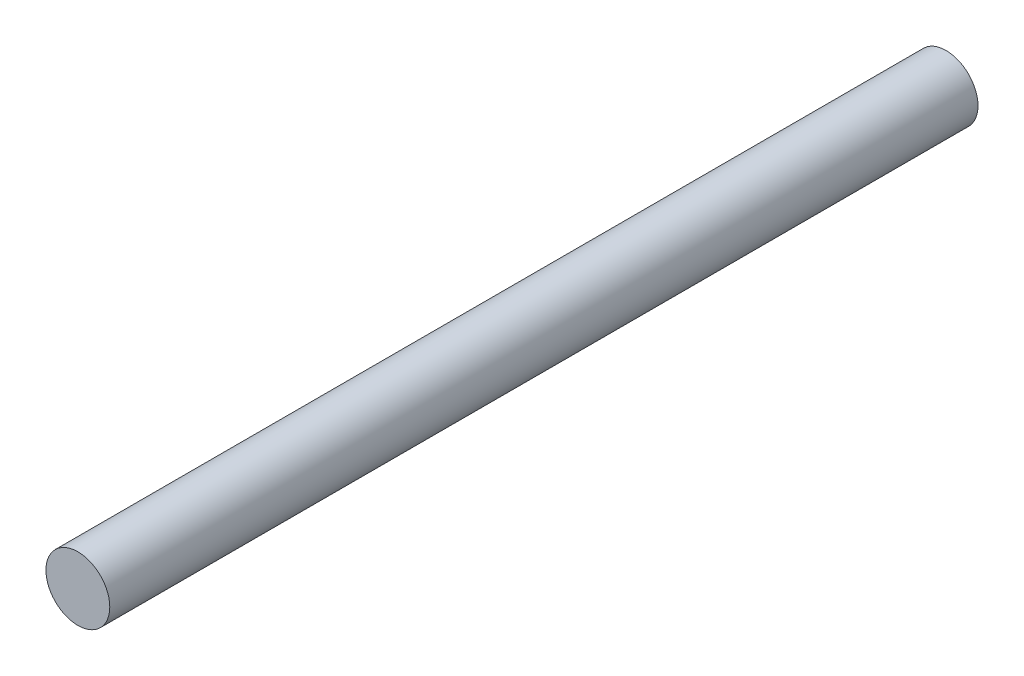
from build123d import *

# Parameters (mm, degrees)
SKETCH1_R           = 1.5
BOSS_EXTRUDE1_DEPTH = 40.8


with BuildPart() as part:
    # Sketch1 → Boss-Extrude1 (new body)
    with BuildSketch(Plane.XY):
        Circle(SKETCH1_R)
    extrude(amount=BOSS_EXTRUDE1_DEPTH)


solid = part.part
